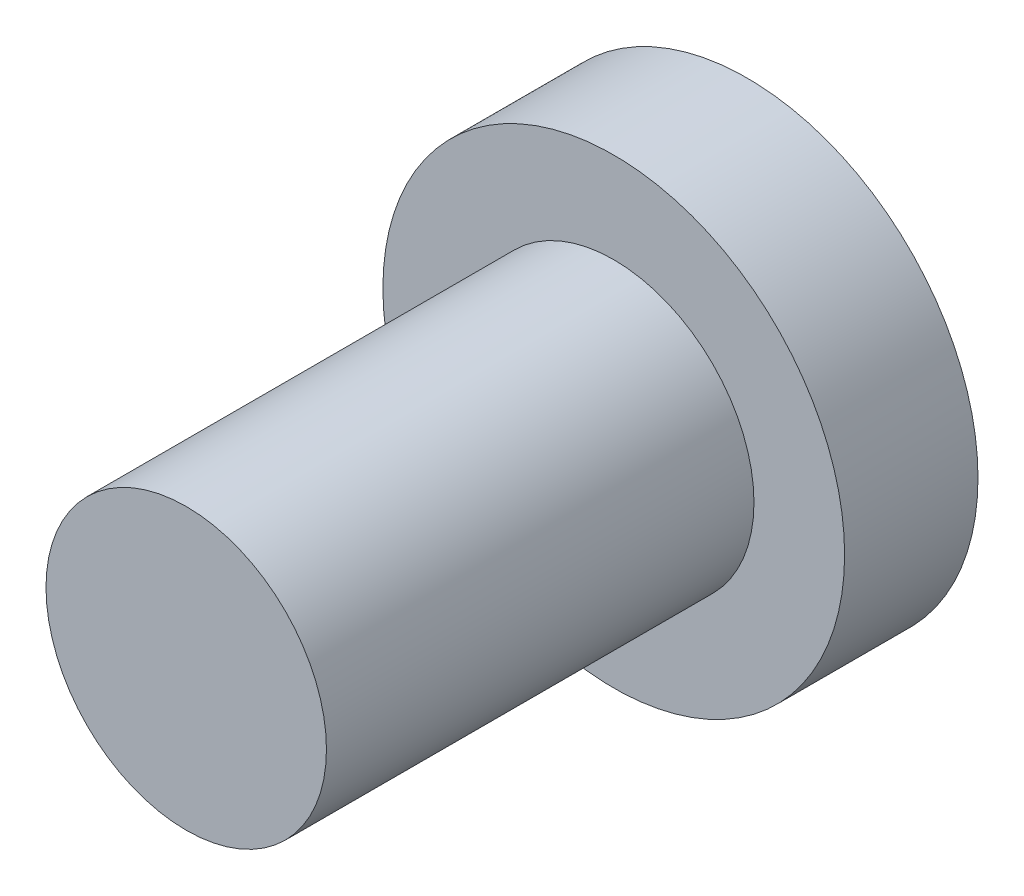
ISO-10303-21;
HEADER;
FILE_DESCRIPTION(('STEP AP214'),'2;1');
FILE_NAME('part.step','',(''),(''),'','','');
FILE_SCHEMA(('AUTOMOTIVE_DESIGN { 1 0 10303 214 1 1 1 1 }'));
ENDSEC;
DATA;
#1=APPLICATION_CONTEXT('core data for automotive mechanical design processes');
#2=APPLICATION_PROTOCOL_DEFINITION('international standard','automotive_design',2000,#1);
#3=PRODUCT_CONTEXT('',#1,'mechanical');
#4=PRODUCT('Part','Part','',(#3));
#5=PRODUCT_RELATED_PRODUCT_CATEGORY('part','',(#4));
#6=PRODUCT_DEFINITION_FORMATION('','',#4);
#7=PRODUCT_DEFINITION_CONTEXT('part definition',#1,'design');
#8=PRODUCT_DEFINITION('design','',#6,#7);
#9=PRODUCT_DEFINITION_SHAPE('','',#8);
#10=(LENGTH_UNIT() NAMED_UNIT(*) SI_UNIT(.MILLI.,.METRE.));
#11=(NAMED_UNIT(*) PLANE_ANGLE_UNIT() SI_UNIT($,.RADIAN.));
#12=(NAMED_UNIT(*) SI_UNIT($,.STERADIAN.) SOLID_ANGLE_UNIT());
#13=UNCERTAINTY_MEASURE_WITH_UNIT(LENGTH_MEASURE(1.E-05),#10,'distance_accuracy_value','');
#14=(GEOMETRIC_REPRESENTATION_CONTEXT(3) GLOBAL_UNCERTAINTY_ASSIGNED_CONTEXT((#13)) GLOBAL_UNIT_ASSIGNED_CONTEXT((#10,
#11,#12)) REPRESENTATION_CONTEXT('',''));
#15=CARTESIAN_POINT('',(0.,0.,0.));
#16=DIRECTION('',(0.,0.,1.));
#17=DIRECTION('',(1.,0.,0.));
#18=AXIS2_PLACEMENT_3D('',#15,#16,#17);
#19=CARTESIAN_POINT('',(0.,0.,6.35));
#20=DIRECTION('',(0.,0.,1.));
#21=DIRECTION('',(1.,0.,0.));
#22=AXIS2_PLACEMENT_3D('',#19,#20,#21);
#23=PLANE('',#22);
#24=CARTESIAN_POINT('',(0.,0.,6.35));
#25=DIRECTION('',(0.,0.,1.));
#26=DIRECTION('',(1.,0.,0.));
#27=AXIS2_PLACEMENT_3D('',#24,#25,#26);
#28=CIRCLE('',#27,2.0828);
#29=CARTESIAN_POINT('',(2.0828,0.,6.35));
#30=VERTEX_POINT('',#29);
#31=EDGE_CURVE('E11',#30,#30,#28,.T.);
#32=ORIENTED_EDGE('',*,*,#31,.T.);
#33=EDGE_LOOP('',(#32));
#34=FACE_BOUND('',#33,.T.);
#35=ADVANCED_FACE('F37',(#34),#23,.T.);
#36=CARTESIAN_POINT('',(0.,0.,6.35));
#37=DIRECTION('',(0.,0.,1.));
#38=DIRECTION('',(1.,0.,0.));
#39=AXIS2_PLACEMENT_3D('',#36,#37,#38);
#40=CYLINDRICAL_SURFACE('',#39,2.0828);
#41=CARTESIAN_POINT('',(0.,0.,0.));
#42=DIRECTION('',(0.,0.,1.));
#43=DIRECTION('',(1.,0.,0.));
#44=AXIS2_PLACEMENT_3D('',#41,#42,#43);
#45=CIRCLE('',#44,2.0828);
#46=CARTESIAN_POINT('',(2.0828,0.,0.));
#47=VERTEX_POINT('',#46);
#48=EDGE_CURVE('E44',#47,#47,#45,.T.);
#49=ORIENTED_EDGE('',*,*,#48,.T.);
#50=EDGE_LOOP('',(#49));
#51=FACE_BOUND('',#50,.T.);
#52=ORIENTED_EDGE('',*,*,#31,.F.);
#53=EDGE_LOOP('',(#52));
#54=FACE_BOUND('',#53,.T.);
#55=ADVANCED_FACE('F151',(#51,#54),#40,.T.);
#56=CARTESIAN_POINT('',(0.,-2.0828,0.));
#57=DIRECTION('',(0.,0.,1.));
#58=DIRECTION('',(1.,0.,0.));
#59=AXIS2_PLACEMENT_3D('',#56,#57,#58);
#60=PLANE('',#59);
#61=CARTESIAN_POINT('',(0.,0.,0.));
#62=DIRECTION('',(0.,0.,1.));
#63=DIRECTION('',(1.,0.,0.));
#64=AXIS2_PLACEMENT_3D('',#61,#62,#63);
#65=CIRCLE('',#64,3.429);
#66=CARTESIAN_POINT('',(3.429,0.,0.));
#67=VERTEX_POINT('',#66);
#68=EDGE_CURVE('E146',#67,#67,#65,.T.);
#69=ORIENTED_EDGE('',*,*,#68,.T.);
#70=EDGE_LOOP('',(#69));
#71=FACE_BOUND('',#70,.T.);
#72=ORIENTED_EDGE('',*,*,#48,.F.);
#73=EDGE_LOOP('',(#72));
#74=FACE_BOUND('',#73,.T.);
#75=ADVANCED_FACE('F154',(#71,#74),#60,.T.);
#76=CARTESIAN_POINT('',(0.,0.,6.35));
#77=DIRECTION('',(0.,0.,1.));
#78=DIRECTION('',(1.,0.,0.));
#79=AXIS2_PLACEMENT_3D('',#76,#77,#78);
#80=CYLINDRICAL_SURFACE('',#79,3.429);
#81=CARTESIAN_POINT('',(0.,0.,-1.9812));
#82=DIRECTION('',(0.,0.,1.));
#83=DIRECTION('',(1.,0.,0.));
#84=AXIS2_PLACEMENT_3D('',#81,#82,#83);
#85=CIRCLE('',#84,3.429);
#86=CARTESIAN_POINT('',(3.429,0.,-1.9812));
#87=VERTEX_POINT('',#86);
#88=EDGE_CURVE('E138',#87,#87,#85,.T.);
#89=ORIENTED_EDGE('',*,*,#88,.T.);
#90=EDGE_LOOP('',(#89));
#91=FACE_BOUND('',#90,.T.);
#92=ORIENTED_EDGE('',*,*,#68,.F.);
#93=EDGE_LOOP('',(#92));
#94=FACE_BOUND('',#93,.T.);
#95=ADVANCED_FACE('F156',(#91,#94),#80,.T.);
#96=CARTESIAN_POINT('',(0.,-3.429,-1.9812));
#97=DIRECTION('',(0.,0.,-1.));
#98=DIRECTION('',(-1.,0.,0.));
#99=AXIS2_PLACEMENT_3D('',#96,#97,#98);
#100=PLANE('',#99);
#101=DIRECTION('',(0.866025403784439,-0.5,0.));
#102=VECTOR('',#101,1.);
#103=CARTESIAN_POINT('',(0.,1.14384635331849,-1.9812));
#104=LINE('',#103,#102);
#105=CARTESIAN_POINT('',(0.,1.14384635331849,-1.9812));
#106=VERTEX_POINT('',#105);
#107=CARTESIAN_POINT('',(0.9906,0.571923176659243,-1.9812));
#108=VERTEX_POINT('',#107);
#109=EDGE_CURVE('E51',#106,#108,#104,.T.);
#110=ORIENTED_EDGE('',*,*,#109,.F.);
#111=DIRECTION('',(0.866025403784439,0.5,0.));
#112=VECTOR('',#111,1.);
#113=CARTESIAN_POINT('',(-0.9906,0.571923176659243,-1.9812));
#114=LINE('',#113,#112);
#115=CARTESIAN_POINT('',(-0.9906,0.571923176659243,-1.9812));
#116=VERTEX_POINT('',#115);
#117=EDGE_CURVE('E134',#116,#106,#114,.T.);
#118=ORIENTED_EDGE('',*,*,#117,.F.);
#119=DIRECTION('',(0.,1.,0.));
#120=VECTOR('',#119,1.);
#121=CARTESIAN_POINT('',(-0.9906,-0.571923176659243,-1.9812));
#122=LINE('',#121,#120);
#123=CARTESIAN_POINT('',(-0.9906,-0.571923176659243,-1.9812));
#124=VERTEX_POINT('',#123);
#125=EDGE_CURVE('E132',#124,#116,#122,.T.);
#126=ORIENTED_EDGE('',*,*,#125,.F.);
#127=DIRECTION('',(-0.866025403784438,0.5,0.));
#128=VECTOR('',#127,1.);
#129=CARTESIAN_POINT('',(0.,-1.14384635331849,-1.9812));
#130=LINE('',#129,#128);
#131=CARTESIAN_POINT('',(0.,-1.14384635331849,-1.9812));
#132=VERTEX_POINT('',#131);
#133=EDGE_CURVE('E99',#132,#124,#130,.T.);
#134=ORIENTED_EDGE('',*,*,#133,.F.);
#135=DIRECTION('',(-0.866025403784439,-0.5,0.));
#136=VECTOR('',#135,1.);
#137=CARTESIAN_POINT('',(0.9906,-0.571923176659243,-1.9812));
#138=LINE('',#137,#136);
#139=CARTESIAN_POINT('',(0.9906,-0.571923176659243,-1.9812));
#140=VERTEX_POINT('',#139);
#141=EDGE_CURVE('E128',#140,#132,#138,.T.);
#142=ORIENTED_EDGE('',*,*,#141,.F.);
#143=DIRECTION('',(0.,-1.,0.));
#144=VECTOR('',#143,1.);
#145=CARTESIAN_POINT('',(0.9906,0.571923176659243,-1.9812));
#146=LINE('',#145,#144);
#147=EDGE_CURVE('E125',#108,#140,#146,.T.);
#148=ORIENTED_EDGE('',*,*,#147,.F.);
#149=EDGE_LOOP('',(#110,#118,#126,#134,#142,#148));
#150=FACE_BOUND('',#149,.T.);
#151=ORIENTED_EDGE('',*,*,#88,.F.);
#152=EDGE_LOOP('',(#151));
#153=FACE_BOUND('',#152,.T.);
#154=ADVANCED_FACE('F163',(#150,#153),#100,.T.);
#155=CARTESIAN_POINT('',(0.,1.14384635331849,-0.4572));
#156=DIRECTION('',(0.5,0.866025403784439,0.));
#157=DIRECTION('',(-0.866025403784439,0.5,0.));
#158=AXIS2_PLACEMENT_3D('',#155,#156,#157);
#159=PLANE('',#158);
#160=ORIENTED_EDGE('',*,*,#109,.T.);
#161=DIRECTION('',(0.,0.,-1.));
#162=VECTOR('',#161,1.);
#163=CARTESIAN_POINT('',(0.9906,0.571923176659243,-0.4572));
#164=LINE('',#163,#162);
#165=CARTESIAN_POINT('',(0.9906,0.571923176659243,-0.4572));
#166=VERTEX_POINT('',#165);
#167=EDGE_CURVE('E81',#166,#108,#164,.T.);
#168=ORIENTED_EDGE('',*,*,#167,.F.);
#169=DIRECTION('',(0.866025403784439,-0.5,0.));
#170=VECTOR('',#169,1.);
#171=CARTESIAN_POINT('',(0.,1.14384635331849,-0.4572));
#172=LINE('',#171,#170);
#173=CARTESIAN_POINT('',(0.,1.14384635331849,-0.4572));
#174=VERTEX_POINT('',#173);
#175=EDGE_CURVE('E136',#174,#166,#172,.T.);
#176=ORIENTED_EDGE('',*,*,#175,.F.);
#177=DIRECTION('',(0.,0.,-1.));
#178=VECTOR('',#177,1.);
#179=CARTESIAN_POINT('',(0.,1.14384635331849,-0.4572));
#180=LINE('',#179,#178);
#181=EDGE_CURVE('E59',#174,#106,#180,.T.);
#182=ORIENTED_EDGE('',*,*,#181,.T.);
#183=EDGE_LOOP('',(#160,#168,#176,#182));
#184=FACE_BOUND('',#183,.T.);
#185=ADVANCED_FACE('F197',(#184),#159,.F.);
#186=CARTESIAN_POINT('',(-0.9906,0.571923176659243,-0.4572));
#187=DIRECTION('',(-0.5,0.866025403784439,0.));
#188=DIRECTION('',(-0.866025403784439,-0.5,0.));
#189=AXIS2_PLACEMENT_3D('',#186,#187,#188);
#190=PLANE('',#189);
#191=ORIENTED_EDGE('',*,*,#117,.T.);
#192=ORIENTED_EDGE('',*,*,#181,.F.);
#193=DIRECTION('',(0.866025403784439,0.5,0.));
#194=VECTOR('',#193,1.);
#195=CARTESIAN_POINT('',(-0.9906,0.571923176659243,-0.4572));
#196=LINE('',#195,#194);
#197=CARTESIAN_POINT('',(-0.9906,0.571923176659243,-0.4572));
#198=VERTEX_POINT('',#197);
#199=EDGE_CURVE('E111',#198,#174,#196,.T.);
#200=ORIENTED_EDGE('',*,*,#199,.F.);
#201=DIRECTION('',(0.,0.,-1.));
#202=VECTOR('',#201,1.);
#203=CARTESIAN_POINT('',(-0.9906,0.571923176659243,-0.4572));
#204=LINE('',#203,#202);
#205=EDGE_CURVE('E103',#198,#116,#204,.T.);
#206=ORIENTED_EDGE('',*,*,#205,.T.);
#207=EDGE_LOOP('',(#191,#192,#200,#206));
#208=FACE_BOUND('',#207,.T.);
#209=ADVANCED_FACE('F208',(#208),#190,.F.);
#210=CARTESIAN_POINT('',(-0.9906,-0.571923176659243,-0.4572));
#211=DIRECTION('',(-1.,0.,0.));
#212=DIRECTION('',(0.,-1.,0.));
#213=AXIS2_PLACEMENT_3D('',#210,#211,#212);
#214=PLANE('',#213);
#215=ORIENTED_EDGE('',*,*,#125,.T.);
#216=ORIENTED_EDGE('',*,*,#205,.F.);
#217=DIRECTION('',(0.,1.,0.));
#218=VECTOR('',#217,1.);
#219=CARTESIAN_POINT('',(-0.9906,-0.571923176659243,-0.4572));
#220=LINE('',#219,#218);
#221=CARTESIAN_POINT('',(-0.9906,-0.571923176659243,-0.4572));
#222=VERTEX_POINT('',#221);
#223=EDGE_CURVE('E107',#222,#198,#220,.T.);
#224=ORIENTED_EDGE('',*,*,#223,.F.);
#225=DIRECTION('',(0.,0.,-1.));
#226=VECTOR('',#225,1.);
#227=CARTESIAN_POINT('',(-0.9906,-0.571923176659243,-0.4572));
#228=LINE('',#227,#226);
#229=EDGE_CURVE('E92',#222,#124,#228,.T.);
#230=ORIENTED_EDGE('',*,*,#229,.T.);
#231=EDGE_LOOP('',(#215,#216,#224,#230));
#232=FACE_BOUND('',#231,.T.);
#233=ADVANCED_FACE('F108',(#232),#214,.F.);
#234=CARTESIAN_POINT('',(0.,-1.14384635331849,-0.4572));
#235=DIRECTION('',(-0.5,-0.866025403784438,0.));
#236=DIRECTION('',(0.866025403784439,-0.5,0.));
#237=AXIS2_PLACEMENT_3D('',#234,#235,#236);
#238=PLANE('',#237);
#239=ORIENTED_EDGE('',*,*,#133,.T.);
#240=ORIENTED_EDGE('',*,*,#229,.F.);
#241=DIRECTION('',(-0.866025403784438,0.5,0.));
#242=VECTOR('',#241,1.);
#243=CARTESIAN_POINT('',(0.,-1.14384635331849,-0.4572));
#244=LINE('',#243,#242);
#245=CARTESIAN_POINT('',(0.,-1.14384635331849,-0.4572));
#246=VERTEX_POINT('',#245);
#247=EDGE_CURVE('E96',#246,#222,#244,.T.);
#248=ORIENTED_EDGE('',*,*,#247,.F.);
#249=DIRECTION('',(0.,0.,-1.));
#250=VECTOR('',#249,1.);
#251=CARTESIAN_POINT('',(0.,-1.14384635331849,-0.4572));
#252=LINE('',#251,#250);
#253=EDGE_CURVE('E104',#246,#132,#252,.T.);
#254=ORIENTED_EDGE('',*,*,#253,.T.);
#255=EDGE_LOOP('',(#239,#240,#248,#254));
#256=FACE_BOUND('',#255,.T.);
#257=ADVANCED_FACE('F94',(#256),#238,.F.);
#258=CARTESIAN_POINT('',(0.9906,-0.571923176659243,-0.4572));
#259=DIRECTION('',(0.5,-0.866025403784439,0.));
#260=DIRECTION('',(0.866025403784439,0.5,0.));
#261=AXIS2_PLACEMENT_3D('',#258,#259,#260);
#262=PLANE('',#261);
#263=ORIENTED_EDGE('',*,*,#141,.T.);
#264=ORIENTED_EDGE('',*,*,#253,.F.);
#265=DIRECTION('',(-0.866025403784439,-0.5,0.));
#266=VECTOR('',#265,1.);
#267=CARTESIAN_POINT('',(0.9906,-0.571923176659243,-0.4572));
#268=LINE('',#267,#266);
#269=CARTESIAN_POINT('',(0.9906,-0.571923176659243,-0.4572));
#270=VERTEX_POINT('',#269);
#271=EDGE_CURVE('E117',#270,#246,#268,.T.);
#272=ORIENTED_EDGE('',*,*,#271,.F.);
#273=DIRECTION('',(0.,0.,-1.));
#274=VECTOR('',#273,1.);
#275=CARTESIAN_POINT('',(0.9906,-0.571923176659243,-0.4572));
#276=LINE('',#275,#274);
#277=EDGE_CURVE('E141',#270,#140,#276,.T.);
#278=ORIENTED_EDGE('',*,*,#277,.T.);
#279=EDGE_LOOP('',(#263,#264,#272,#278));
#280=FACE_BOUND('',#279,.T.);
#281=ADVANCED_FACE('F236',(#280),#262,.F.);
#282=CARTESIAN_POINT('',(0.9906,0.571923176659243,-0.4572));
#283=DIRECTION('',(1.,0.,0.));
#284=DIRECTION('',(0.,0.,-1.));
#285=AXIS2_PLACEMENT_3D('',#282,#283,#284);
#286=PLANE('',#285);
#287=ORIENTED_EDGE('',*,*,#147,.T.);
#288=ORIENTED_EDGE('',*,*,#277,.F.);
#289=DIRECTION('',(0.,-1.,0.));
#290=VECTOR('',#289,1.);
#291=CARTESIAN_POINT('',(0.9906,0.571923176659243,-0.4572));
#292=LINE('',#291,#290);
#293=EDGE_CURVE('E119',#166,#270,#292,.T.);
#294=ORIENTED_EDGE('',*,*,#293,.F.);
#295=ORIENTED_EDGE('',*,*,#167,.T.);
#296=EDGE_LOOP('',(#287,#288,#294,#295));
#297=FACE_BOUND('',#296,.T.);
#298=ADVANCED_FACE('F246',(#297),#286,.F.);
#299=CARTESIAN_POINT('',(1.9812,0.,-0.4572));
#300=DIRECTION('',(0.,0.,-1.));
#301=DIRECTION('',(-1.,0.,0.));
#302=AXIS2_PLACEMENT_3D('',#299,#300,#301);
#303=PLANE('',#302);
#304=ORIENTED_EDGE('',*,*,#175,.T.);
#305=ORIENTED_EDGE('',*,*,#293,.T.);
#306=ORIENTED_EDGE('',*,*,#271,.T.);
#307=ORIENTED_EDGE('',*,*,#247,.T.);
#308=ORIENTED_EDGE('',*,*,#223,.T.);
#309=ORIENTED_EDGE('',*,*,#199,.T.);
#310=EDGE_LOOP('',(#304,#305,#306,#307,#308,#309));
#311=FACE_BOUND('',#310,.T.);
#312=ADVANCED_FACE('F114',(#311),#303,.T.);
#313=CLOSED_SHELL('',(#35,#55,#75,#95,#154,#185,#209,#233,#257,#281,#298,#312));
#314=MANIFOLD_SOLID_BREP('B2',#313);
#315=ADVANCED_BREP_SHAPE_REPRESENTATION('',(#18,#314),#14);
#316=SHAPE_DEFINITION_REPRESENTATION(#9,#315);
ENDSEC;
END-ISO-10303-21;
